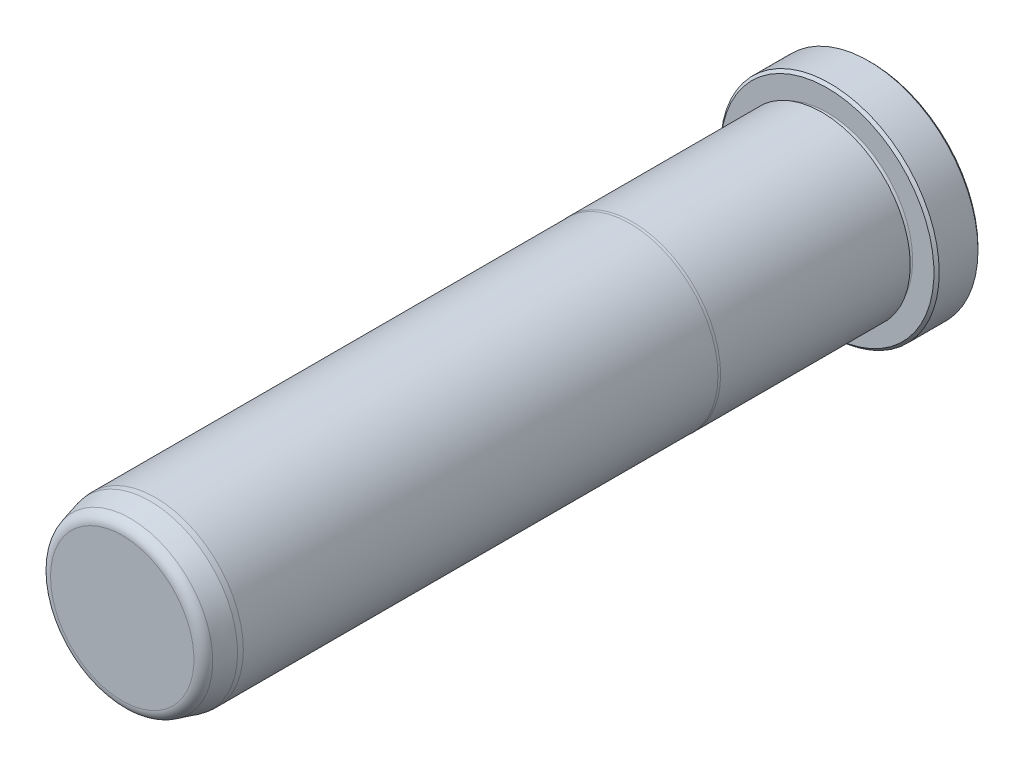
from build123d import *

# Parameters (mm, degrees)
FILLET6_R     = 1.5875
CHAMFER1_SIZE = 0.381


with BuildPart() as part:
    # Sketch1 → Revolve1 (revolve)
    with BuildSketch(Plane(origin=(0, 0, 0), x_dir=(0, 0, -1), z_dir=(1, 0, 0)), mode=Mode.PRIVATE) as revolve1_sk:
        with BuildLine():
            Line((0, 0), (0, 15.748))
            Line((0, 15.748), (-6.35, 15.748))
            Line((-6.35, 15.748), (-6.35, 12.3063))
            ThreePointArc((-6.35, 12.3063), (-6.731, 11.9253), (-7.112, 12.3063))
            Line((-7.112, 12.3063), (-7.112, 12.7127))
            Line((-7.112, 12.7127), (-34.434763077, 12.7127))
            Line((-34.434763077, 12.7127), (-34.798, 12.6873))
            Line((-34.798, 12.6873), (-103.1875, 12.6873))
            Line((-103.1875, 12.6873), (-103.9495, 12.620633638))
            Line((-103.9495, 12.620633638), (-107.95, 11.548702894))
            Line((-107.95, 11.548702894), (-107.95, 0))
            Line((-107.95, 0), (0, 0))
        make_face()
    revolve(revolve1_sk.sketch.rotate(Axis((0, 0, 0), (0, 0, -1)), 90), axis=Axis((0, 0, 0), (0, 0, -1)))

    # Fillet6
    fillet6_edges = [part.edges().sort_by_distance(p)[0] for p in [
        (-11.548702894, 0, 107.95),
    ]]
    fillet(fillet6_edges, radius=FILLET6_R)

    # Chamfer1
    chamfer1_edges = [part.edges().sort_by_distance(p)[0] for p in [
        (-15.748, 0, 6.35),
        (-15.748, 0, 0),
    ]]
    chamfer(chamfer1_edges, length=CHAMFER1_SIZE)


solid = part.part
